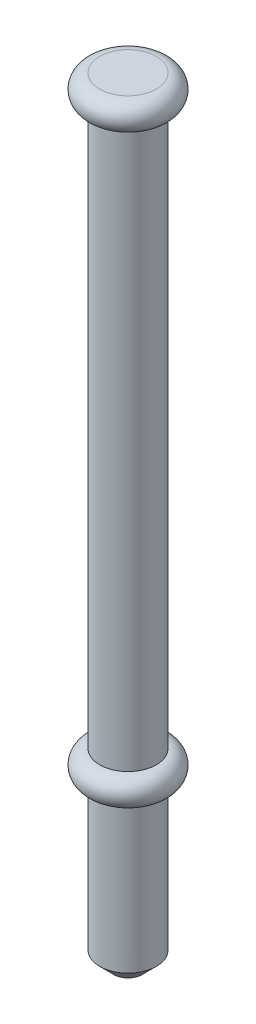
from build123d import *

# Parameters (mm, degrees)
ESQUISSE3_R      = 6
EXTRUSION1_DEPTH = 164
CHANFREIN1_SIZE  = 3


with BuildPart() as part:
    # Esquisse3 → Extrusion1 (new body)
    with BuildSketch(Plane(origin=(0, 0, 0), x_dir=(1, 0, 0), z_dir=(0, 1, 0))):
        with Locations(Location((0, 0, 0), (0, 0, 90))):
            Circle(ESQUISSE3_R)
    extrude(amount=EXTRUSION1_DEPTH)

    # Esquisse4 → sertissages (revolve)
    with BuildSketch(Plane.XY, mode=Mode.PRIVATE) as sertissages_sk:
        with BuildLine():
            Line((6, 164), (6, 158))
            ThreePointArc((6, 158), (9, 161), (6, 164))
        make_face()
        with BuildLine():
            Line((6, 40), (6, 34))
            ThreePointArc((6, 34), (9, 37), (6, 40))
        make_face()
    revolve(sertissages_sk.sketch.rotate(Axis((0, 0, 0), (0, 1, 0)), 90), axis=Axis((0, 0, 0), (0, 1, 0)))

    # Chanfrein1
    chanfrein1_edges = [part.edges().sort_by_distance(p)[0] for p in [
        (0, 0, 6),
    ]]
    chamfer(chanfrein1_edges, length=CHANFREIN1_SIZE)


solid = part.part
